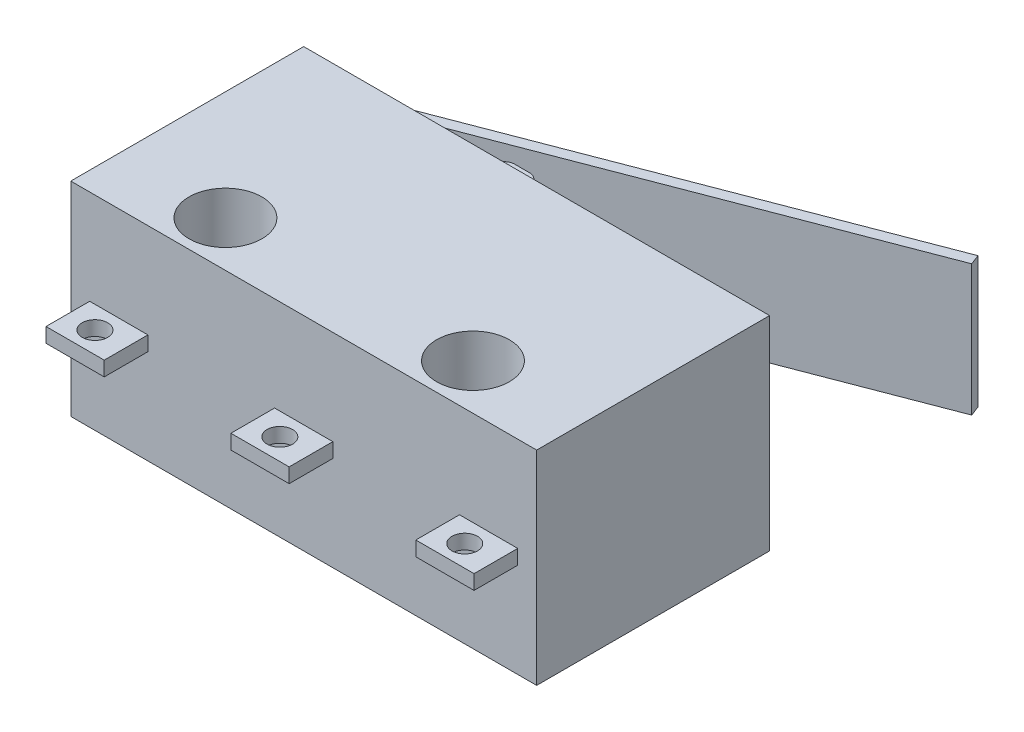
ISO-10303-21;
HEADER;
FILE_DESCRIPTION(('STEP AP214'),'2;1');
FILE_NAME('part.step','',(''),(''),'','','');
FILE_SCHEMA(('AUTOMOTIVE_DESIGN { 1 0 10303 214 1 1 1 1 }'));
ENDSEC;
DATA;
#1=APPLICATION_CONTEXT('core data for automotive mechanical design processes');
#2=APPLICATION_PROTOCOL_DEFINITION('international standard','automotive_design',2000,#1);
#3=PRODUCT_CONTEXT('',#1,'mechanical');
#4=PRODUCT('Part','Part','',(#3));
#5=PRODUCT_RELATED_PRODUCT_CATEGORY('part','',(#4));
#6=PRODUCT_DEFINITION_FORMATION('','',#4);
#7=PRODUCT_DEFINITION_CONTEXT('part definition',#1,'design');
#8=PRODUCT_DEFINITION('design','',#6,#7);
#9=PRODUCT_DEFINITION_SHAPE('','',#8);
#10=(LENGTH_UNIT() NAMED_UNIT(*) SI_UNIT(.MILLI.,.METRE.));
#11=(NAMED_UNIT(*) PLANE_ANGLE_UNIT() SI_UNIT($,.RADIAN.));
#12=(NAMED_UNIT(*) SI_UNIT($,.STERADIAN.) SOLID_ANGLE_UNIT());
#13=UNCERTAINTY_MEASURE_WITH_UNIT(LENGTH_MEASURE(1.E-05),#10,'distance_accuracy_value','');
#14=(GEOMETRIC_REPRESENTATION_CONTEXT(3) GLOBAL_UNCERTAINTY_ASSIGNED_CONTEXT((#13)) GLOBAL_UNIT_ASSIGNED_CONTEXT((#10,
#11,#12)) REPRESENTATION_CONTEXT('',''));
#15=CARTESIAN_POINT('',(0.,0.,0.));
#16=DIRECTION('',(0.,0.,1.));
#17=DIRECTION('',(1.,0.,0.));
#18=AXIS2_PLACEMENT_3D('',#15,#16,#17);
#19=CARTESIAN_POINT('',(0.,5.6,0.));
#20=DIRECTION('',(0.,0.,-1.));
#21=DIRECTION('',(-1.,0.,0.));
#22=AXIS2_PLACEMENT_3D('',#19,#20,#21);
#23=PLANE('',#22);
#24=DIRECTION('',(1.,0.,0.));
#25=VECTOR('',#24,1.);
#26=CARTESIAN_POINT('',(5.6,2.6,0.));
#27=LINE('',#26,#25);
#28=CARTESIAN_POINT('',(5.6,2.6,0.));
#29=VERTEX_POINT('',#28);
#30=CARTESIAN_POINT('',(7.2,2.6,0.));
#31=VERTEX_POINT('',#30);
#32=EDGE_CURVE('E256',#29,#31,#27,.T.);
#33=ORIENTED_EDGE('',*,*,#32,.F.);
#34=DIRECTION('',(0.,-1.,0.));
#35=VECTOR('',#34,1.);
#36=CARTESIAN_POINT('',(5.6,3.,0.));
#37=LINE('',#36,#35);
#38=CARTESIAN_POINT('',(5.6,3.,0.));
#39=VERTEX_POINT('',#38);
#40=EDGE_CURVE('E269',#39,#29,#37,.T.);
#41=ORIENTED_EDGE('',*,*,#40,.F.);
#42=DIRECTION('',(-1.,0.,0.));
#43=VECTOR('',#42,1.);
#44=CARTESIAN_POINT('',(5.6,3.,0.));
#45=LINE('',#44,#43);
#46=CARTESIAN_POINT('',(7.2,3.,0.));
#47=VERTEX_POINT('',#46);
#48=EDGE_CURVE('E278',#47,#39,#45,.T.);
#49=ORIENTED_EDGE('',*,*,#48,.F.);
#50=DIRECTION('',(0.,1.,0.));
#51=VECTOR('',#50,1.);
#52=CARTESIAN_POINT('',(7.2,3.,0.));
#53=LINE('',#52,#51);
#54=EDGE_CURVE('E259',#31,#47,#53,.T.);
#55=ORIENTED_EDGE('',*,*,#54,.F.);
#56=EDGE_LOOP('',(#33,#41,#49,#55));
#57=FACE_BOUND('',#56,.T.);
#58=DIRECTION('',(1.,0.,0.));
#59=VECTOR('',#58,1.);
#60=CARTESIAN_POINT('',(0.,0.,0.));
#61=LINE('',#60,#59);
#62=CARTESIAN_POINT('',(0.,0.,0.));
#63=VERTEX_POINT('',#62);
#64=CARTESIAN_POINT('',(12.8,0.,0.));
#65=VERTEX_POINT('',#64);
#66=EDGE_CURVE('E440',#63,#65,#61,.T.);
#67=ORIENTED_EDGE('',*,*,#66,.T.);
#68=DIRECTION('',(0.,-1.,0.));
#69=VECTOR('',#68,1.);
#70=CARTESIAN_POINT('',(12.8,5.6,0.));
#71=LINE('',#70,#69);
#72=CARTESIAN_POINT('',(12.8,5.6,0.));
#73=VERTEX_POINT('',#72);
#74=EDGE_CURVE('E461',#73,#65,#71,.T.);
#75=ORIENTED_EDGE('',*,*,#74,.F.);
#76=DIRECTION('',(1.,0.,0.));
#77=VECTOR('',#76,1.);
#78=CARTESIAN_POINT('',(0.,5.6,0.));
#79=LINE('',#78,#77);
#80=CARTESIAN_POINT('',(0.,5.6,0.));
#81=VERTEX_POINT('',#80);
#82=EDGE_CURVE('E449',#81,#73,#79,.T.);
#83=ORIENTED_EDGE('',*,*,#82,.F.);
#84=DIRECTION('',(0.,-1.,0.));
#85=VECTOR('',#84,1.);
#86=CARTESIAN_POINT('',(0.,5.6,0.));
#87=LINE('',#86,#85);
#88=EDGE_CURVE('E464',#81,#63,#87,.T.);
#89=ORIENTED_EDGE('',*,*,#88,.T.);
#90=EDGE_LOOP('',(#67,#75,#83,#89));
#91=FACE_BOUND('',#90,.T.);
#92=DIRECTION('',(0.,1.,0.));
#93=VECTOR('',#92,1.);
#94=CARTESIAN_POINT('',(2.12,3.,0.));
#95=LINE('',#94,#93);
#96=CARTESIAN_POINT('',(2.12,2.6,0.));
#97=VERTEX_POINT('',#96);
#98=CARTESIAN_POINT('',(2.12,3.,0.));
#99=VERTEX_POINT('',#98);
#100=EDGE_CURVE('E294',#97,#99,#95,.T.);
#101=ORIENTED_EDGE('',*,*,#100,.F.);
#102=DIRECTION('',(1.,0.,0.));
#103=VECTOR('',#102,1.);
#104=CARTESIAN_POINT('',(0.52,2.6,0.));
#105=LINE('',#104,#103);
#106=CARTESIAN_POINT('',(0.52,2.6,0.));
#107=VERTEX_POINT('',#106);
#108=EDGE_CURVE('E299',#107,#97,#105,.T.);
#109=ORIENTED_EDGE('',*,*,#108,.F.);
#110=DIRECTION('',(0.,-1.,0.));
#111=VECTOR('',#110,1.);
#112=CARTESIAN_POINT('',(0.52,3.,0.));
#113=LINE('',#112,#111);
#114=CARTESIAN_POINT('',(0.52,3.,0.));
#115=VERTEX_POINT('',#114);
#116=EDGE_CURVE('E311',#115,#107,#113,.T.);
#117=ORIENTED_EDGE('',*,*,#116,.F.);
#118=DIRECTION('',(-1.,0.,0.));
#119=VECTOR('',#118,1.);
#120=CARTESIAN_POINT('',(0.52,3.,0.));
#121=LINE('',#120,#119);
#122=EDGE_CURVE('E308',#99,#115,#121,.T.);
#123=ORIENTED_EDGE('',*,*,#122,.F.);
#124=EDGE_LOOP('',(#101,#109,#117,#123));
#125=FACE_BOUND('',#124,.T.);
#126=DIRECTION('',(1.,0.,0.));
#127=VECTOR('',#126,1.);
#128=CARTESIAN_POINT('',(10.68,2.6,0.));
#129=LINE('',#128,#127);
#130=CARTESIAN_POINT('',(10.68,2.6,0.));
#131=VERTEX_POINT('',#130);
#132=CARTESIAN_POINT('',(12.28,2.6,0.));
#133=VERTEX_POINT('',#132);
#134=EDGE_CURVE('E255',#131,#133,#129,.T.);
#135=ORIENTED_EDGE('',*,*,#134,.F.);
#136=DIRECTION('',(0.,-1.,0.));
#137=VECTOR('',#136,1.);
#138=CARTESIAN_POINT('',(10.68,3.,0.));
#139=LINE('',#138,#137);
#140=CARTESIAN_POINT('',(10.68,3.,0.));
#141=VERTEX_POINT('',#140);
#142=EDGE_CURVE('E252',#141,#131,#139,.T.);
#143=ORIENTED_EDGE('',*,*,#142,.F.);
#144=DIRECTION('',(-1.,0.,0.));
#145=VECTOR('',#144,1.);
#146=CARTESIAN_POINT('',(10.68,3.,0.));
#147=LINE('',#146,#145);
#148=CARTESIAN_POINT('',(12.28,3.,0.));
#149=VERTEX_POINT('',#148);
#150=EDGE_CURVE('E59',#149,#141,#147,.T.);
#151=ORIENTED_EDGE('',*,*,#150,.F.);
#152=DIRECTION('',(0.,1.,0.));
#153=VECTOR('',#152,1.);
#154=CARTESIAN_POINT('',(12.28,3.,0.));
#155=LINE('',#154,#153);
#156=EDGE_CURVE('E54',#133,#149,#155,.T.);
#157=ORIENTED_EDGE('',*,*,#156,.F.);
#158=EDGE_LOOP('',(#135,#143,#151,#157));
#159=FACE_BOUND('',#158,.T.);
#160=ADVANCED_FACE('F37',(#57,#91,#125,#159),#23,.F.);
#161=CARTESIAN_POINT('',(0.,5.6,-6.4));
#162=DIRECTION('',(0.,0.,1.));
#163=DIRECTION('',(1.,0.,0.));
#164=AXIS2_PLACEMENT_3D('',#161,#162,#163);
#165=PLANE('',#164);
#166=DIRECTION('',(0.,1.,0.));
#167=VECTOR('',#166,1.);
#168=CARTESIAN_POINT('',(4.,1.4,-6.4));
#169=LINE('',#168,#167);
#170=CARTESIAN_POINT('',(4.,1.4,-6.4));
#171=VERTEX_POINT('',#170);
#172=CARTESIAN_POINT('',(4.,4.2,-6.4));
#173=VERTEX_POINT('',#172);
#174=EDGE_CURVE('E399',#171,#173,#169,.T.);
#175=ORIENTED_EDGE('',*,*,#174,.F.);
#176=DIRECTION('',(-1.,0.,0.));
#177=VECTOR('',#176,1.);
#178=CARTESIAN_POINT('',(4.,1.4,-6.4));
#179=LINE('',#178,#177);
#180=CARTESIAN_POINT('',(5.,1.4,-6.4));
#181=VERTEX_POINT('',#180);
#182=EDGE_CURVE('E408',#181,#171,#179,.T.);
#183=ORIENTED_EDGE('',*,*,#182,.F.);
#184=DIRECTION('',(0.,-1.,0.));
#185=VECTOR('',#184,1.);
#186=CARTESIAN_POINT('',(5.,1.4,-6.4));
#187=LINE('',#186,#185);
#188=CARTESIAN_POINT('',(5.,4.2,-6.4));
#189=VERTEX_POINT('',#188);
#190=EDGE_CURVE('E405',#189,#181,#187,.T.);
#191=ORIENTED_EDGE('',*,*,#190,.F.);
#192=DIRECTION('',(1.,0.,0.));
#193=VECTOR('',#192,1.);
#194=CARTESIAN_POINT('',(4.,4.2,-6.4));
#195=LINE('',#194,#193);
#196=EDGE_CURVE('E402',#173,#189,#195,.T.);
#197=ORIENTED_EDGE('',*,*,#196,.F.);
#198=EDGE_LOOP('',(#175,#183,#191,#197));
#199=FACE_BOUND('',#198,.T.);
#200=DIRECTION('',(-1.,0.,0.));
#201=VECTOR('',#200,1.);
#202=CARTESIAN_POINT('',(0.,0.,-6.4));
#203=LINE('',#202,#201);
#204=CARTESIAN_POINT('',(12.8,0.,-6.4));
#205=VERTEX_POINT('',#204);
#206=CARTESIAN_POINT('',(0.,0.,-6.4));
#207=VERTEX_POINT('',#206);
#208=EDGE_CURVE('E444',#205,#207,#203,.T.);
#209=ORIENTED_EDGE('',*,*,#208,.T.);
#210=DIRECTION('',(0.,-1.,0.));
#211=VECTOR('',#210,1.);
#212=CARTESIAN_POINT('',(0.,5.6,-6.4));
#213=LINE('',#212,#211);
#214=CARTESIAN_POINT('',(0.,5.6,-6.4));
#215=VERTEX_POINT('',#214);
#216=EDGE_CURVE('E455',#215,#207,#213,.T.);
#217=ORIENTED_EDGE('',*,*,#216,.F.);
#218=DIRECTION('',(-1.,0.,0.));
#219=VECTOR('',#218,1.);
#220=CARTESIAN_POINT('',(0.,5.6,-6.4));
#221=LINE('',#220,#219);
#222=CARTESIAN_POINT('',(12.8,5.6,-6.4));
#223=VERTEX_POINT('',#222);
#224=EDGE_CURVE('E453',#223,#215,#221,.T.);
#225=ORIENTED_EDGE('',*,*,#224,.F.);
#226=DIRECTION('',(0.,-1.,0.));
#227=VECTOR('',#226,1.);
#228=CARTESIAN_POINT('',(12.8,5.6,-6.4));
#229=LINE('',#228,#227);
#230=EDGE_CURVE('E458',#223,#205,#229,.T.);
#231=ORIENTED_EDGE('',*,*,#230,.T.);
#232=EDGE_LOOP('',(#209,#217,#225,#231));
#233=FACE_BOUND('',#232,.T.);
#234=DIRECTION('',(0.,-1.,0.));
#235=VECTOR('',#234,1.);
#236=CARTESIAN_POINT('',(1.3,4.6,-6.4));
#237=LINE('',#236,#235);
#238=CARTESIAN_POINT('',(1.3,4.6,-6.4));
#239=VERTEX_POINT('',#238);
#240=CARTESIAN_POINT('',(1.3,1.,-6.4));
#241=VERTEX_POINT('',#240);
#242=EDGE_CURVE('E327',#239,#241,#237,.T.);
#243=ORIENTED_EDGE('',*,*,#242,.F.);
#244=DIRECTION('',(1.,0.,0.));
#245=VECTOR('',#244,1.);
#246=CARTESIAN_POINT('',(1.3,4.6,-6.4));
#247=LINE('',#246,#245);
#248=CARTESIAN_POINT('',(0.999999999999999,4.6,-6.4));
#249=VERTEX_POINT('',#248);
#250=EDGE_CURVE('E332',#249,#239,#247,.T.);
#251=ORIENTED_EDGE('',*,*,#250,.F.);
#252=DIRECTION('',(0.,1.,0.));
#253=VECTOR('',#252,1.);
#254=CARTESIAN_POINT('',(0.999999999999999,4.6,-6.4));
#255=LINE('',#254,#253);
#256=CARTESIAN_POINT('',(0.999999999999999,1.,-6.4));
#257=VERTEX_POINT('',#256);
#258=EDGE_CURVE('E341',#257,#249,#255,.T.);
#259=ORIENTED_EDGE('',*,*,#258,.F.);
#260=DIRECTION('',(-1.,0.,0.));
#261=VECTOR('',#260,1.);
#262=CARTESIAN_POINT('',(1.3,1.,-6.4));
#263=LINE('',#262,#261);
#264=EDGE_CURVE('E338',#241,#257,#263,.T.);
#265=ORIENTED_EDGE('',*,*,#264,.F.);
#266=EDGE_LOOP('',(#243,#251,#259,#265));
#267=FACE_BOUND('',#266,.T.);
#268=ADVANCED_FACE('F524',(#199,#233,#267),#165,.F.);
#269=CARTESIAN_POINT('',(0.,5.6,-6.4));
#270=DIRECTION('',(0.,-1.,0.));
#271=DIRECTION('',(0.,0.,-1.));
#272=AXIS2_PLACEMENT_3D('',#269,#270,#271);
#273=PLANE('',#272);
#274=CARTESIAN_POINT('',(3.,5.6,-1.25));
#275=DIRECTION('',(0.,1.,0.));
#276=DIRECTION('',(0.,0.,1.));
#277=AXIS2_PLACEMENT_3D('',#274,#275,#276);
#278=CIRCLE('',#277,1.);
#279=CARTESIAN_POINT('',(3.,5.6,-0.25));
#280=VERTEX_POINT('',#279);
#281=EDGE_CURVE('E434',#280,#280,#278,.T.);
#282=ORIENTED_EDGE('',*,*,#281,.F.);
#283=EDGE_LOOP('',(#282));
#284=FACE_BOUND('',#283,.T.);
#285=DIRECTION('',(0.,0.,1.));
#286=VECTOR('',#285,1.);
#287=CARTESIAN_POINT('',(0.,5.6,0.));
#288=LINE('',#287,#286);
#289=EDGE_CURVE('E446',#215,#81,#288,.T.);
#290=ORIENTED_EDGE('',*,*,#289,.T.);
#291=ORIENTED_EDGE('',*,*,#82,.T.);
#292=DIRECTION('',(0.,0.,-1.));
#293=VECTOR('',#292,1.);
#294=CARTESIAN_POINT('',(12.8,5.6,0.));
#295=LINE('',#294,#293);
#296=EDGE_CURVE('E451',#73,#223,#295,.T.);
#297=ORIENTED_EDGE('',*,*,#296,.T.);
#298=ORIENTED_EDGE('',*,*,#224,.T.);
#299=EDGE_LOOP('',(#290,#291,#297,#298));
#300=FACE_BOUND('',#299,.T.);
#301=CARTESIAN_POINT('',(9.8,5.6,-1.25));
#302=DIRECTION('',(0.,1.,0.));
#303=DIRECTION('',(0.,0.,-1.));
#304=AXIS2_PLACEMENT_3D('',#301,#302,#303);
#305=CIRCLE('',#304,1.);
#306=CARTESIAN_POINT('',(9.8,5.6,-2.25));
#307=VERTEX_POINT('',#306);
#308=EDGE_CURVE('E428',#307,#307,#305,.T.);
#309=ORIENTED_EDGE('',*,*,#308,.F.);
#310=EDGE_LOOP('',(#309));
#311=FACE_BOUND('',#310,.T.);
#312=ADVANCED_FACE('F529',(#284,#300,#311),#273,.F.);
#313=CARTESIAN_POINT('',(0.,0.,-6.4));
#314=DIRECTION('',(0.,-1.,0.));
#315=DIRECTION('',(0.,0.,-1.));
#316=AXIS2_PLACEMENT_3D('',#313,#314,#315);
#317=PLANE('',#316);
#318=CARTESIAN_POINT('',(3.,0.,-1.25));
#319=DIRECTION('',(0.,1.,0.));
#320=DIRECTION('',(0.,0.,1.));
#321=AXIS2_PLACEMENT_3D('',#318,#319,#320);
#322=CIRCLE('',#321,1.);
#323=CARTESIAN_POINT('',(3.,0.,-0.25));
#324=VERTEX_POINT('',#323);
#325=EDGE_CURVE('E431',#324,#324,#322,.T.);
#326=ORIENTED_EDGE('',*,*,#325,.T.);
#327=EDGE_LOOP('',(#326));
#328=FACE_BOUND('',#327,.T.);
#329=DIRECTION('',(0.,0.,1.));
#330=VECTOR('',#329,1.);
#331=CARTESIAN_POINT('',(0.,0.,0.));
#332=LINE('',#331,#330);
#333=EDGE_CURVE('E437',#207,#63,#332,.T.);
#334=ORIENTED_EDGE('',*,*,#333,.F.);
#335=ORIENTED_EDGE('',*,*,#208,.F.);
#336=DIRECTION('',(0.,0.,-1.));
#337=VECTOR('',#336,1.);
#338=CARTESIAN_POINT('',(12.8,0.,0.));
#339=LINE('',#338,#337);
#340=EDGE_CURVE('E442',#65,#205,#339,.T.);
#341=ORIENTED_EDGE('',*,*,#340,.F.);
#342=ORIENTED_EDGE('',*,*,#66,.F.);
#343=EDGE_LOOP('',(#334,#335,#341,#342));
#344=FACE_BOUND('',#343,.T.);
#345=CARTESIAN_POINT('',(9.8,0.,-1.25));
#346=DIRECTION('',(0.,1.,0.));
#347=DIRECTION('',(0.,0.,-1.));
#348=AXIS2_PLACEMENT_3D('',#345,#346,#347);
#349=CIRCLE('',#348,1.);
#350=CARTESIAN_POINT('',(9.8,0.,-2.25));
#351=VERTEX_POINT('',#350);
#352=EDGE_CURVE('E425',#351,#351,#349,.T.);
#353=ORIENTED_EDGE('',*,*,#352,.T.);
#354=EDGE_LOOP('',(#353));
#355=FACE_BOUND('',#354,.T.);
#356=ADVANCED_FACE('F541',(#328,#344,#355),#317,.T.);
#357=CARTESIAN_POINT('',(0.,5.6,0.));
#358=DIRECTION('',(1.,0.,0.));
#359=DIRECTION('',(0.,0.,-1.));
#360=AXIS2_PLACEMENT_3D('',#357,#358,#359);
#361=PLANE('',#360);
#362=ORIENTED_EDGE('',*,*,#333,.T.);
#363=ORIENTED_EDGE('',*,*,#88,.F.);
#364=ORIENTED_EDGE('',*,*,#289,.F.);
#365=ORIENTED_EDGE('',*,*,#216,.T.);
#366=EDGE_LOOP('',(#362,#363,#364,#365));
#367=FACE_BOUND('',#366,.T.);
#368=ADVANCED_FACE('F39',(#367),#361,.F.);
#369=CARTESIAN_POINT('',(12.8,5.6,0.));
#370=DIRECTION('',(-1.,0.,0.));
#371=DIRECTION('',(0.,0.,1.));
#372=AXIS2_PLACEMENT_3D('',#369,#370,#371);
#373=PLANE('',#372);
#374=ORIENTED_EDGE('',*,*,#340,.T.);
#375=ORIENTED_EDGE('',*,*,#230,.F.);
#376=ORIENTED_EDGE('',*,*,#296,.F.);
#377=ORIENTED_EDGE('',*,*,#74,.T.);
#378=EDGE_LOOP('',(#374,#375,#376,#377));
#379=FACE_BOUND('',#378,.T.);
#380=ADVANCED_FACE('F534',(#379),#373,.F.);
#381=CARTESIAN_POINT('',(3.,5.6,-1.25));
#382=DIRECTION('',(0.,-1.,0.));
#383=DIRECTION('',(0.,0.,-1.));
#384=AXIS2_PLACEMENT_3D('',#381,#382,#383);
#385=CYLINDRICAL_SURFACE('',#384,1.);
#386=ORIENTED_EDGE('',*,*,#281,.T.);
#387=EDGE_LOOP('',(#386));
#388=FACE_BOUND('',#387,.T.);
#389=ORIENTED_EDGE('',*,*,#325,.F.);
#390=EDGE_LOOP('',(#389));
#391=FACE_BOUND('',#390,.T.);
#392=ADVANCED_FACE('F536',(#388,#391),#385,.F.);
#393=CARTESIAN_POINT('',(9.8,5.6,-1.25));
#394=DIRECTION('',(0.,-1.,0.));
#395=DIRECTION('',(0.,0.,-1.));
#396=AXIS2_PLACEMENT_3D('',#393,#394,#395);
#397=CYLINDRICAL_SURFACE('',#396,1.);
#398=ORIENTED_EDGE('',*,*,#308,.T.);
#399=EDGE_LOOP('',(#398));
#400=FACE_BOUND('',#399,.T.);
#401=ORIENTED_EDGE('',*,*,#352,.F.);
#402=EDGE_LOOP('',(#401));
#403=FACE_BOUND('',#402,.T.);
#404=ADVANCED_FACE('F548',(#400,#403),#397,.F.);
#405=CARTESIAN_POINT('',(4.,1.4,-7.9));
#406=DIRECTION('',(1.,0.,0.));
#407=DIRECTION('',(0.,0.,-1.));
#408=AXIS2_PLACEMENT_3D('',#405,#406,#407);
#409=PLANE('',#408);
#410=DIRECTION('',(0.,0.,1.));
#411=VECTOR('',#410,1.);
#412=CARTESIAN_POINT('',(4.,4.2,-7.9));
#413=LINE('',#412,#411);
#414=CARTESIAN_POINT('',(4.,4.2,-7.6));
#415=VERTEX_POINT('',#414);
#416=EDGE_CURVE('E423',#415,#173,#413,.T.);
#417=ORIENTED_EDGE('',*,*,#416,.F.);
#418=DIRECTION('',(0.,1.,0.));
#419=VECTOR('',#418,1.);
#420=CARTESIAN_POINT('',(4.,1.4,-7.6));
#421=LINE('',#420,#419);
#422=CARTESIAN_POINT('',(4.,1.4,-7.6));
#423=VERTEX_POINT('',#422);
#424=EDGE_CURVE('E11',#415,#423,#421,.F.);
#425=ORIENTED_EDGE('',*,*,#424,.T.);
#426=DIRECTION('',(0.,0.,1.));
#427=VECTOR('',#426,1.);
#428=CARTESIAN_POINT('',(4.,1.4,-7.9));
#429=LINE('',#428,#427);
#430=EDGE_CURVE('E417',#423,#171,#429,.T.);
#431=ORIENTED_EDGE('',*,*,#430,.T.);
#432=ORIENTED_EDGE('',*,*,#174,.T.);
#433=EDGE_LOOP('',(#417,#425,#431,#432));
#434=FACE_BOUND('',#433,.T.);
#435=ADVANCED_FACE('F552',(#434),#409,.F.);
#436=CARTESIAN_POINT('',(4.,4.2,-7.9));
#437=DIRECTION('',(0.,-1.,0.));
#438=DIRECTION('',(0.,0.,-1.));
#439=AXIS2_PLACEMENT_3D('',#436,#437,#438);
#440=PLANE('',#439);
#441=DIRECTION('',(0.,0.,1.));
#442=VECTOR('',#441,1.);
#443=CARTESIAN_POINT('',(5.,4.2,-7.9));
#444=LINE('',#443,#442);
#445=CARTESIAN_POINT('',(5.,4.2,-7.6));
#446=VERTEX_POINT('',#445);
#447=EDGE_CURVE('E421',#446,#189,#444,.T.);
#448=ORIENTED_EDGE('',*,*,#447,.F.);
#449=CARTESIAN_POINT('',(4.7,4.2,-7.6));
#450=DIRECTION('',(0.,-1.,0.));
#451=DIRECTION('',(0.,0.,-1.));
#452=AXIS2_PLACEMENT_3D('',#449,#450,#451);
#453=CIRCLE('',#452,0.3);
#454=CARTESIAN_POINT('',(4.7,4.2,-7.9));
#455=VERTEX_POINT('',#454);
#456=EDGE_CURVE('E46',#446,#455,#453,.F.);
#457=ORIENTED_EDGE('',*,*,#456,.T.);
#458=DIRECTION('',(1.,0.,0.));
#459=VECTOR('',#458,1.);
#460=CARTESIAN_POINT('',(4.,4.2,-7.9));
#461=LINE('',#460,#459);
#462=CARTESIAN_POINT('',(4.3,4.2,-7.9));
#463=VERTEX_POINT('',#462);
#464=EDGE_CURVE('E411',#463,#455,#461,.T.);
#465=ORIENTED_EDGE('',*,*,#464,.F.);
#466=CARTESIAN_POINT('',(4.3,4.2,-7.6));
#467=DIRECTION('',(0.,-1.,0.));
#468=DIRECTION('',(0.,0.,-1.));
#469=AXIS2_PLACEMENT_3D('',#466,#467,#468);
#470=CIRCLE('',#469,0.3);
#471=EDGE_CURVE('E479',#463,#415,#470,.F.);
#472=ORIENTED_EDGE('',*,*,#471,.T.);
#473=ORIENTED_EDGE('',*,*,#416,.T.);
#474=ORIENTED_EDGE('',*,*,#196,.T.);
#475=EDGE_LOOP('',(#448,#457,#465,#472,#473,#474));
#476=FACE_BOUND('',#475,.T.);
#477=ADVANCED_FACE('F556',(#476),#440,.F.);
#478=CARTESIAN_POINT('',(5.,1.4,-7.9));
#479=DIRECTION('',(-1.,0.,0.));
#480=DIRECTION('',(0.,0.,1.));
#481=AXIS2_PLACEMENT_3D('',#478,#479,#480);
#482=PLANE('',#481);
#483=DIRECTION('',(0.,0.,1.));
#484=VECTOR('',#483,1.);
#485=CARTESIAN_POINT('',(5.,1.4,-7.9));
#486=LINE('',#485,#484);
#487=CARTESIAN_POINT('',(5.,1.4,-7.6));
#488=VERTEX_POINT('',#487);
#489=EDGE_CURVE('E419',#488,#181,#486,.T.);
#490=ORIENTED_EDGE('',*,*,#489,.F.);
#491=DIRECTION('',(0.,-1.,0.));
#492=VECTOR('',#491,1.);
#493=CARTESIAN_POINT('',(5.,4.2,-7.6));
#494=LINE('',#493,#492);
#495=EDGE_CURVE('E477',#488,#446,#494,.F.);
#496=ORIENTED_EDGE('',*,*,#495,.T.);
#497=ORIENTED_EDGE('',*,*,#447,.T.);
#498=ORIENTED_EDGE('',*,*,#190,.T.);
#499=EDGE_LOOP('',(#490,#496,#497,#498));
#500=FACE_BOUND('',#499,.T.);
#501=ADVANCED_FACE('F560',(#500),#482,.F.);
#502=CARTESIAN_POINT('',(4.,1.4,-7.9));
#503=DIRECTION('',(0.,1.,0.));
#504=DIRECTION('',(0.,0.,1.));
#505=AXIS2_PLACEMENT_3D('',#502,#503,#504);
#506=PLANE('',#505);
#507=DIRECTION('',(-1.,0.,0.));
#508=VECTOR('',#507,1.);
#509=CARTESIAN_POINT('',(4.,1.4,-7.9));
#510=LINE('',#509,#508);
#511=CARTESIAN_POINT('',(4.7,1.4,-7.9));
#512=VERTEX_POINT('',#511);
#513=CARTESIAN_POINT('',(4.3,1.4,-7.9));
#514=VERTEX_POINT('',#513);
#515=EDGE_CURVE('E414',#512,#514,#510,.T.);
#516=ORIENTED_EDGE('',*,*,#515,.F.);
#517=CARTESIAN_POINT('',(4.7,1.4,-7.6));
#518=DIRECTION('',(0.,1.,0.));
#519=DIRECTION('',(0.,0.,1.));
#520=AXIS2_PLACEMENT_3D('',#517,#518,#519);
#521=CIRCLE('',#520,0.3);
#522=EDGE_CURVE('E475',#512,#488,#521,.F.);
#523=ORIENTED_EDGE('',*,*,#522,.T.);
#524=ORIENTED_EDGE('',*,*,#489,.T.);
#525=ORIENTED_EDGE('',*,*,#182,.T.);
#526=ORIENTED_EDGE('',*,*,#430,.F.);
#527=CARTESIAN_POINT('',(4.3,1.4,-7.6));
#528=DIRECTION('',(0.,1.,0.));
#529=DIRECTION('',(0.,0.,1.));
#530=AXIS2_PLACEMENT_3D('',#527,#528,#529);
#531=CIRCLE('',#530,0.3);
#532=EDGE_CURVE('E473',#423,#514,#531,.F.);
#533=ORIENTED_EDGE('',*,*,#532,.T.);
#534=EDGE_LOOP('',(#516,#523,#524,#525,#526,#533));
#535=FACE_BOUND('',#534,.T.);
#536=ADVANCED_FACE('F564',(#535),#506,.F.);
#537=CARTESIAN_POINT('',(4.,4.2,-7.9));
#538=DIRECTION('',(0.,0.,-1.));
#539=DIRECTION('',(-1.,0.,0.));
#540=AXIS2_PLACEMENT_3D('',#537,#538,#539);
#541=PLANE('',#540);
#542=ORIENTED_EDGE('',*,*,#464,.T.);
#543=DIRECTION('',(0.,-1.,0.));
#544=VECTOR('',#543,1.);
#545=CARTESIAN_POINT('',(4.7,1.4,-7.9));
#546=LINE('',#545,#544);
#547=EDGE_CURVE('E470',#455,#512,#546,.T.);
#548=ORIENTED_EDGE('',*,*,#547,.T.);
#549=ORIENTED_EDGE('',*,*,#515,.T.);
#550=DIRECTION('',(0.,1.,0.));
#551=VECTOR('',#550,1.);
#552=CARTESIAN_POINT('',(4.3,4.2,-7.9));
#553=LINE('',#552,#551);
#554=EDGE_CURVE('E467',#514,#463,#553,.T.);
#555=ORIENTED_EDGE('',*,*,#554,.T.);
#556=EDGE_LOOP('',(#542,#548,#549,#555));
#557=FACE_BOUND('',#556,.T.);
#558=ADVANCED_FACE('F568',(#557),#541,.T.);
#559=CARTESIAN_POINT('',(4.7,4.2,-7.6));
#560=DIRECTION('',(0.,1.,0.));
#561=DIRECTION('',(0.,0.,1.));
#562=AXIS2_PLACEMENT_3D('',#559,#560,#561);
#563=CYLINDRICAL_SURFACE('',#562,0.3);
#564=ORIENTED_EDGE('',*,*,#456,.F.);
#565=ORIENTED_EDGE('',*,*,#495,.F.);
#566=ORIENTED_EDGE('',*,*,#522,.F.);
#567=ORIENTED_EDGE('',*,*,#547,.F.);
#568=EDGE_LOOP('',(#564,#565,#566,#567));
#569=FACE_BOUND('',#568,.T.);
#570=ADVANCED_FACE('F572',(#569),#563,.T.);
#571=CARTESIAN_POINT('',(4.3,4.2,-7.6));
#572=DIRECTION('',(0.,-1.,0.));
#573=DIRECTION('',(0.,0.,-1.));
#574=AXIS2_PLACEMENT_3D('',#571,#572,#573);
#575=CYLINDRICAL_SURFACE('',#574,0.3);
#576=ORIENTED_EDGE('',*,*,#532,.F.);
#577=ORIENTED_EDGE('',*,*,#424,.F.);
#578=ORIENTED_EDGE('',*,*,#471,.F.);
#579=ORIENTED_EDGE('',*,*,#554,.F.);
#580=EDGE_LOOP('',(#576,#577,#578,#579));
#581=FACE_BOUND('',#580,.T.);
#582=ADVANCED_FACE('F576',(#581),#575,.T.);
#583=CARTESIAN_POINT('',(1.2569879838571,4.6,-7.1015752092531));
#584=DIRECTION('',(-0.357530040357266,0.,-0.933901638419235));
#585=DIRECTION('',(-0.933901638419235,0.,0.357530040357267));
#586=AXIS2_PLACEMENT_3D('',#583,#584,#585);
#587=PLANE('',#586);
#588=DIRECTION('',(0.,1.,0.));
#589=VECTOR('',#588,1.);
#590=CARTESIAN_POINT('',(1.2569879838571,4.6,-7.1015752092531));
#591=LINE('',#590,#589);
#592=CARTESIAN_POINT('',(1.2569879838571,1.,-7.1015752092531));
#593=VERTEX_POINT('',#592);
#594=CARTESIAN_POINT('',(1.2569879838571,4.6,-7.1015752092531));
#595=VERTEX_POINT('',#594);
#596=EDGE_CURVE('E360',#593,#595,#591,.T.);
#597=ORIENTED_EDGE('',*,*,#596,.T.);
#598=DIRECTION('',(0.933901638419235,0.,-0.357530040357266));
#599=VECTOR('',#598,1.);
#600=CARTESIAN_POINT('',(1.2569879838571,4.6,-7.1015752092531));
#601=LINE('',#600,#599);
#602=CARTESIAN_POINT('',(13.2370917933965,4.6,-11.6879757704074));
#603=VERTEX_POINT('',#602);
#604=EDGE_CURVE('E390',#595,#603,#601,.T.);
#605=ORIENTED_EDGE('',*,*,#604,.T.);
#606=DIRECTION('',(0.,1.,0.));
#607=VECTOR('',#606,1.);
#608=CARTESIAN_POINT('',(13.2370917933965,4.6,-11.6879757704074));
#609=LINE('',#608,#607);
#610=CARTESIAN_POINT('',(13.2370917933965,1.,-11.6879757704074));
#611=VERTEX_POINT('',#610);
#612=EDGE_CURVE('E381',#611,#603,#609,.T.);
#613=ORIENTED_EDGE('',*,*,#612,.F.);
#614=DIRECTION('',(0.933901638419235,0.,-0.357530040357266));
#615=VECTOR('',#614,1.);
#616=CARTESIAN_POINT('',(1.2569879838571,1.,-7.1015752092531));
#617=LINE('',#616,#615);
#618=EDGE_CURVE('E393',#593,#611,#617,.T.);
#619=ORIENTED_EDGE('',*,*,#618,.F.);
#620=EDGE_LOOP('',(#597,#605,#613,#619));
#621=FACE_BOUND('',#620,.T.);
#622=ADVANCED_FACE('F580',(#621),#587,.T.);
#623=CARTESIAN_POINT('',(1.36424699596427,4.6,-6.82140471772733));
#624=DIRECTION('',(0.357530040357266,0.,0.933901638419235));
#625=DIRECTION('',(0.933901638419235,0.,-0.357530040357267));
#626=AXIS2_PLACEMENT_3D('',#623,#624,#625);
#627=PLANE('',#626);
#628=DIRECTION('',(0.,-1.,0.));
#629=VECTOR('',#628,1.);
#630=CARTESIAN_POINT('',(1.36424699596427,4.6,-6.82140471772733));
#631=LINE('',#630,#629);
#632=CARTESIAN_POINT('',(1.36424699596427,4.6,-6.82140471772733));
#633=VERTEX_POINT('',#632);
#634=CARTESIAN_POINT('',(1.36424699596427,1.,-6.82140471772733));
#635=VERTEX_POINT('',#634);
#636=EDGE_CURVE('E357',#633,#635,#631,.T.);
#637=ORIENTED_EDGE('',*,*,#636,.T.);
#638=DIRECTION('',(0.933901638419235,0.,-0.357530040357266));
#639=VECTOR('',#638,1.);
#640=CARTESIAN_POINT('',(1.36424699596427,1.,-6.82140471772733));
#641=LINE('',#640,#639);
#642=CARTESIAN_POINT('',(13.3443508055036,1.,-11.4078052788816));
#643=VERTEX_POINT('',#642);
#644=EDGE_CURVE('E396',#635,#643,#641,.T.);
#645=ORIENTED_EDGE('',*,*,#644,.T.);
#646=DIRECTION('',(0.,-1.,0.));
#647=VECTOR('',#646,1.);
#648=CARTESIAN_POINT('',(13.3443508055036,4.6,-11.4078052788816));
#649=LINE('',#648,#647);
#650=CARTESIAN_POINT('',(13.3443508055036,4.6,-11.4078052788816));
#651=VERTEX_POINT('',#650);
#652=EDGE_CURVE('E375',#651,#643,#649,.T.);
#653=ORIENTED_EDGE('',*,*,#652,.F.);
#654=DIRECTION('',(0.933901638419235,0.,-0.357530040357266));
#655=VECTOR('',#654,1.);
#656=CARTESIAN_POINT('',(1.36424699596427,4.6,-6.82140471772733));
#657=LINE('',#656,#655);
#658=EDGE_CURVE('E387',#633,#651,#657,.T.);
#659=ORIENTED_EDGE('',*,*,#658,.F.);
#660=EDGE_LOOP('',(#637,#645,#653,#659));
#661=FACE_BOUND('',#660,.T.);
#662=ADVANCED_FACE('F584',(#661),#627,.T.);
#663=CARTESIAN_POINT('',(1.4,2.8,-6.72801455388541));
#664=DIRECTION('',(0.,-1.,0.));
#665=DIRECTION('',(0.,0.,-1.));
#666=AXIS2_PLACEMENT_3D('',#663,#664,#665);
#667=CYLINDRICAL_SURFACE('',#666,0.400000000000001);
#668=DIRECTION('',(0.,1.,0.));
#669=VECTOR('',#668,1.);
#670=CARTESIAN_POINT('',(1.,4.6,-6.7280145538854));
#671=LINE('',#670,#669);
#672=CARTESIAN_POINT('',(1.,1.,-6.7280145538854));
#673=VERTEX_POINT('',#672);
#674=CARTESIAN_POINT('',(1.,4.6,-6.7280145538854));
#675=VERTEX_POINT('',#674);
#676=EDGE_CURVE('E331',#673,#675,#671,.T.);
#677=ORIENTED_EDGE('',*,*,#676,.T.);
#678=CARTESIAN_POINT('',(1.4,4.6,-6.72801455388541));
#679=DIRECTION('',(0.,-1.,0.));
#680=DIRECTION('',(0.,0.,-1.));
#681=AXIS2_PLACEMENT_3D('',#678,#679,#680);
#682=CIRCLE('',#681,0.400000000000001);
#683=EDGE_CURVE('E366',#675,#595,#682,.T.);
#684=ORIENTED_EDGE('',*,*,#683,.T.);
#685=ORIENTED_EDGE('',*,*,#596,.F.);
#686=CARTESIAN_POINT('',(1.4,1.,-6.72801455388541));
#687=DIRECTION('',(0.,-1.,0.));
#688=DIRECTION('',(0.,0.,-1.));
#689=AXIS2_PLACEMENT_3D('',#686,#687,#688);
#690=CIRCLE('',#689,0.400000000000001);
#691=EDGE_CURVE('E369',#673,#593,#690,.T.);
#692=ORIENTED_EDGE('',*,*,#691,.F.);
#693=EDGE_LOOP('',(#677,#684,#685,#692));
#694=FACE_BOUND('',#693,.T.);
#695=ADVANCED_FACE('F588',(#694),#667,.T.);
#696=CARTESIAN_POINT('',(1.4,2.8,-6.72801455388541));
#697=DIRECTION('',(0.,-1.,0.));
#698=DIRECTION('',(0.,0.,-1.));
#699=AXIS2_PLACEMENT_3D('',#696,#697,#698);
#700=CYLINDRICAL_SURFACE('',#699,0.1);
#701=DIRECTION('',(0.,-1.,0.));
#702=VECTOR('',#701,1.);
#703=CARTESIAN_POINT('',(1.3,4.6,-6.7280145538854));
#704=LINE('',#703,#702);
#705=CARTESIAN_POINT('',(1.3,4.6,-6.7280145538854));
#706=VERTEX_POINT('',#705);
#707=CARTESIAN_POINT('',(1.3,1.,-6.7280145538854));
#708=VERTEX_POINT('',#707);
#709=EDGE_CURVE('E328',#706,#708,#704,.T.);
#710=ORIENTED_EDGE('',*,*,#709,.T.);
#711=CARTESIAN_POINT('',(1.4,1.,-6.72801455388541));
#712=DIRECTION('',(0.,-1.,0.));
#713=DIRECTION('',(0.,0.,-1.));
#714=AXIS2_PLACEMENT_3D('',#711,#712,#713);
#715=CIRCLE('',#714,0.1);
#716=EDGE_CURVE('E372',#708,#635,#715,.T.);
#717=ORIENTED_EDGE('',*,*,#716,.T.);
#718=ORIENTED_EDGE('',*,*,#636,.F.);
#719=CARTESIAN_POINT('',(1.4,4.6,-6.72801455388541));
#720=DIRECTION('',(0.,-1.,0.));
#721=DIRECTION('',(0.,0.,-1.));
#722=AXIS2_PLACEMENT_3D('',#719,#720,#721);
#723=CIRCLE('',#722,0.1);
#724=EDGE_CURVE('E363',#706,#633,#723,.T.);
#725=ORIENTED_EDGE('',*,*,#724,.F.);
#726=EDGE_LOOP('',(#710,#717,#718,#725));
#727=FACE_BOUND('',#726,.T.);
#728=ADVANCED_FACE('F592',(#727),#700,.F.);
#729=CARTESIAN_POINT('',(1.3,4.6,-6.7280145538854));
#730=DIRECTION('',(-1.,0.,0.));
#731=DIRECTION('',(0.,0.,1.));
#732=AXIS2_PLACEMENT_3D('',#729,#730,#731);
#733=PLANE('',#732);
#734=ORIENTED_EDGE('',*,*,#242,.T.);
#735=DIRECTION('',(0.,0.,1.));
#736=VECTOR('',#735,1.);
#737=CARTESIAN_POINT('',(1.3,1.,-6.7280145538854));
#738=LINE('',#737,#736);
#739=EDGE_CURVE('E354',#708,#241,#738,.T.);
#740=ORIENTED_EDGE('',*,*,#739,.F.);
#741=ORIENTED_EDGE('',*,*,#709,.F.);
#742=DIRECTION('',(0.,0.,1.));
#743=VECTOR('',#742,1.);
#744=CARTESIAN_POINT('',(1.3,4.6,-6.7280145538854));
#745=LINE('',#744,#743);
#746=EDGE_CURVE('E335',#706,#239,#745,.T.);
#747=ORIENTED_EDGE('',*,*,#746,.T.);
#748=EDGE_LOOP('',(#734,#740,#741,#747));
#749=FACE_BOUND('',#748,.T.);
#750=ADVANCED_FACE('F596',(#749),#733,.F.);
#751=CARTESIAN_POINT('',(1.3,1.,-6.7280145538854));
#752=DIRECTION('',(0.,1.,0.));
#753=DIRECTION('',(0.,0.,1.));
#754=AXIS2_PLACEMENT_3D('',#751,#752,#753);
#755=PLANE('',#754);
#756=ORIENTED_EDGE('',*,*,#264,.T.);
#757=DIRECTION('',(0.,0.,1.));
#758=VECTOR('',#757,1.);
#759=CARTESIAN_POINT('',(1.,1.,-6.7280145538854));
#760=LINE('',#759,#758);
#761=EDGE_CURVE('E351',#673,#257,#760,.T.);
#762=ORIENTED_EDGE('',*,*,#761,.F.);
#763=ORIENTED_EDGE('',*,*,#691,.T.);
#764=ORIENTED_EDGE('',*,*,#618,.T.);
#765=DIRECTION('',(-0.357530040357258,0.,-0.933901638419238));
#766=VECTOR('',#765,1.);
#767=CARTESIAN_POINT('',(13.3443508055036,1.,-11.4078052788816));
#768=LINE('',#767,#766);
#769=EDGE_CURVE('E384',#643,#611,#768,.T.);
#770=ORIENTED_EDGE('',*,*,#769,.F.);
#771=ORIENTED_EDGE('',*,*,#644,.F.);
#772=ORIENTED_EDGE('',*,*,#716,.F.);
#773=ORIENTED_EDGE('',*,*,#739,.T.);
#774=EDGE_LOOP('',(#756,#762,#763,#764,#770,#771,#772,#773));
#775=FACE_BOUND('',#774,.T.);
#776=ADVANCED_FACE('F600',(#775),#755,.F.);
#777=CARTESIAN_POINT('',(1.,4.6,-6.7280145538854));
#778=DIRECTION('',(1.,0.,0.));
#779=DIRECTION('',(0.,0.,-1.));
#780=AXIS2_PLACEMENT_3D('',#777,#778,#779);
#781=PLANE('',#780);
#782=ORIENTED_EDGE('',*,*,#258,.T.);
#783=DIRECTION('',(0.,0.,1.));
#784=VECTOR('',#783,1.);
#785=CARTESIAN_POINT('',(1.,4.6,-6.7280145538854));
#786=LINE('',#785,#784);
#787=EDGE_CURVE('E348',#675,#249,#786,.T.);
#788=ORIENTED_EDGE('',*,*,#787,.F.);
#789=ORIENTED_EDGE('',*,*,#676,.F.);
#790=ORIENTED_EDGE('',*,*,#761,.T.);
#791=EDGE_LOOP('',(#782,#788,#789,#790));
#792=FACE_BOUND('',#791,.T.);
#793=ADVANCED_FACE('F604',(#792),#781,.F.);
#794=CARTESIAN_POINT('',(1.3,4.6,-6.7280145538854));
#795=DIRECTION('',(0.,-1.,0.));
#796=DIRECTION('',(0.,0.,-1.));
#797=AXIS2_PLACEMENT_3D('',#794,#795,#796);
#798=PLANE('',#797);
#799=ORIENTED_EDGE('',*,*,#250,.T.);
#800=ORIENTED_EDGE('',*,*,#746,.F.);
#801=ORIENTED_EDGE('',*,*,#724,.T.);
#802=ORIENTED_EDGE('',*,*,#658,.T.);
#803=DIRECTION('',(0.357530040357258,0.,0.933901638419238));
#804=VECTOR('',#803,1.);
#805=CARTESIAN_POINT('',(13.3443508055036,4.6,-11.4078052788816));
#806=LINE('',#805,#804);
#807=EDGE_CURVE('E378',#603,#651,#806,.T.);
#808=ORIENTED_EDGE('',*,*,#807,.F.);
#809=ORIENTED_EDGE('',*,*,#604,.F.);
#810=ORIENTED_EDGE('',*,*,#683,.F.);
#811=ORIENTED_EDGE('',*,*,#787,.T.);
#812=EDGE_LOOP('',(#799,#800,#801,#802,#808,#809,#810,#811));
#813=FACE_BOUND('',#812,.T.);
#814=ADVANCED_FACE('F608',(#813),#798,.F.);
#815=CARTESIAN_POINT('',(13.3443508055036,1.,-11.4078052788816));
#816=DIRECTION('',(0.933901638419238,0.,-0.357530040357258));
#817=DIRECTION('',(-0.357530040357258,0.,-0.933901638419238));
#818=AXIS2_PLACEMENT_3D('',#815,#816,#817);
#819=PLANE('',#818);
#820=ORIENTED_EDGE('',*,*,#652,.T.);
#821=ORIENTED_EDGE('',*,*,#769,.T.);
#822=ORIENTED_EDGE('',*,*,#612,.T.);
#823=ORIENTED_EDGE('',*,*,#807,.T.);
#824=EDGE_LOOP('',(#820,#821,#822,#823));
#825=FACE_BOUND('',#824,.T.);
#826=ADVANCED_FACE('F612',(#825),#819,.T.);
#827=CARTESIAN_POINT('',(2.12,3.,1.2));
#828=DIRECTION('',(-1.,0.,0.));
#829=DIRECTION('',(0.,-1.,0.));
#830=AXIS2_PLACEMENT_3D('',#827,#828,#829);
#831=PLANE('',#830);
#832=ORIENTED_EDGE('',*,*,#100,.T.);
#833=DIRECTION('',(0.,0.,-1.));
#834=VECTOR('',#833,1.);
#835=CARTESIAN_POINT('',(2.12,3.,1.2));
#836=LINE('',#835,#834);
#837=CARTESIAN_POINT('',(2.12,3.,1.2));
#838=VERTEX_POINT('',#837);
#839=EDGE_CURVE('E324',#838,#99,#836,.T.);
#840=ORIENTED_EDGE('',*,*,#839,.F.);
#841=DIRECTION('',(0.,1.,0.));
#842=VECTOR('',#841,1.);
#843=CARTESIAN_POINT('',(2.12,3.,1.2));
#844=LINE('',#843,#842);
#845=CARTESIAN_POINT('',(2.12,2.6,1.2));
#846=VERTEX_POINT('',#845);
#847=EDGE_CURVE('E295',#846,#838,#844,.T.);
#848=ORIENTED_EDGE('',*,*,#847,.F.);
#849=DIRECTION('',(0.,0.,-1.));
#850=VECTOR('',#849,1.);
#851=CARTESIAN_POINT('',(2.12,2.6,1.2));
#852=LINE('',#851,#850);
#853=EDGE_CURVE('E305',#846,#97,#852,.T.);
#854=ORIENTED_EDGE('',*,*,#853,.T.);
#855=EDGE_LOOP('',(#832,#840,#848,#854));
#856=FACE_BOUND('',#855,.T.);
#857=ADVANCED_FACE('F616',(#856),#831,.F.);
#858=CARTESIAN_POINT('',(0.52,3.,1.2));
#859=DIRECTION('',(0.,-1.,0.));
#860=DIRECTION('',(0.,0.,-1.));
#861=AXIS2_PLACEMENT_3D('',#858,#859,#860);
#862=PLANE('',#861);
#863=CARTESIAN_POINT('',(1.27739132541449,3.,0.612967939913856));
#864=DIRECTION('',(0.,-1.,0.));
#865=DIRECTION('',(0.,0.,-1.));
#866=AXIS2_PLACEMENT_3D('',#863,#864,#865);
#867=CIRCLE('',#866,0.35);
#868=CARTESIAN_POINT('',(1.27739132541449,3.,0.262967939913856));
#869=VERTEX_POINT('',#868);
#870=EDGE_CURVE('E488',#869,#869,#867,.T.);
#871=ORIENTED_EDGE('',*,*,#870,.T.);
#872=EDGE_LOOP('',(#871));
#873=FACE_BOUND('',#872,.T.);
#874=ORIENTED_EDGE('',*,*,#122,.T.);
#875=DIRECTION('',(0.,0.,-1.));
#876=VECTOR('',#875,1.);
#877=CARTESIAN_POINT('',(0.52,3.,1.2));
#878=LINE('',#877,#876);
#879=CARTESIAN_POINT('',(0.52,3.,1.2));
#880=VERTEX_POINT('',#879);
#881=EDGE_CURVE('E321',#880,#115,#878,.T.);
#882=ORIENTED_EDGE('',*,*,#881,.F.);
#883=DIRECTION('',(-1.,0.,0.));
#884=VECTOR('',#883,1.);
#885=CARTESIAN_POINT('',(0.52,3.,1.2));
#886=LINE('',#885,#884);
#887=EDGE_CURVE('E298',#838,#880,#886,.T.);
#888=ORIENTED_EDGE('',*,*,#887,.F.);
#889=ORIENTED_EDGE('',*,*,#839,.T.);
#890=EDGE_LOOP('',(#874,#882,#888,#889));
#891=FACE_BOUND('',#890,.T.);
#892=ADVANCED_FACE('F620',(#873,#891),#862,.F.);
#893=CARTESIAN_POINT('',(0.52,3.,1.2));
#894=DIRECTION('',(1.,0.,0.));
#895=DIRECTION('',(0.,0.,-1.));
#896=AXIS2_PLACEMENT_3D('',#893,#894,#895);
#897=PLANE('',#896);
#898=ORIENTED_EDGE('',*,*,#116,.T.);
#899=DIRECTION('',(0.,0.,-1.));
#900=VECTOR('',#899,1.);
#901=CARTESIAN_POINT('',(0.52,2.6,1.2));
#902=LINE('',#901,#900);
#903=CARTESIAN_POINT('',(0.52,2.6,1.2));
#904=VERTEX_POINT('',#903);
#905=EDGE_CURVE('E318',#904,#107,#902,.T.);
#906=ORIENTED_EDGE('',*,*,#905,.F.);
#907=DIRECTION('',(0.,-1.,0.));
#908=VECTOR('',#907,1.);
#909=CARTESIAN_POINT('',(0.52,3.,1.2));
#910=LINE('',#909,#908);
#911=EDGE_CURVE('E301',#880,#904,#910,.T.);
#912=ORIENTED_EDGE('',*,*,#911,.F.);
#913=ORIENTED_EDGE('',*,*,#881,.T.);
#914=EDGE_LOOP('',(#898,#906,#912,#913));
#915=FACE_BOUND('',#914,.T.);
#916=ADVANCED_FACE('F624',(#915),#897,.F.);
#917=CARTESIAN_POINT('',(0.52,2.6,1.2));
#918=DIRECTION('',(0.,1.,0.));
#919=DIRECTION('',(0.,0.,1.));
#920=AXIS2_PLACEMENT_3D('',#917,#918,#919);
#921=PLANE('',#920);
#922=CARTESIAN_POINT('',(1.27739132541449,2.6,0.612967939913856));
#923=DIRECTION('',(0.,-1.,0.));
#924=DIRECTION('',(0.,0.,-1.));
#925=AXIS2_PLACEMENT_3D('',#922,#923,#924);
#926=CIRCLE('',#925,0.35);
#927=CARTESIAN_POINT('',(1.27739132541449,2.6,0.262967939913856));
#928=VERTEX_POINT('',#927);
#929=EDGE_CURVE('E483',#928,#928,#926,.T.);
#930=ORIENTED_EDGE('',*,*,#929,.F.);
#931=EDGE_LOOP('',(#930));
#932=FACE_BOUND('',#931,.T.);
#933=ORIENTED_EDGE('',*,*,#108,.T.);
#934=ORIENTED_EDGE('',*,*,#853,.F.);
#935=DIRECTION('',(1.,0.,0.));
#936=VECTOR('',#935,1.);
#937=CARTESIAN_POINT('',(0.52,2.6,1.2));
#938=LINE('',#937,#936);
#939=EDGE_CURVE('E303',#904,#846,#938,.T.);
#940=ORIENTED_EDGE('',*,*,#939,.F.);
#941=ORIENTED_EDGE('',*,*,#905,.T.);
#942=EDGE_LOOP('',(#933,#934,#940,#941));
#943=FACE_BOUND('',#942,.T.);
#944=ADVANCED_FACE('F628',(#932,#943),#921,.F.);
#945=CARTESIAN_POINT('',(0.,0.,1.2));
#946=DIRECTION('',(0.,0.,1.));
#947=DIRECTION('',(1.,0.,0.));
#948=AXIS2_PLACEMENT_3D('',#945,#946,#947);
#949=PLANE('',#948);
#950=ORIENTED_EDGE('',*,*,#847,.T.);
#951=ORIENTED_EDGE('',*,*,#887,.T.);
#952=ORIENTED_EDGE('',*,*,#911,.T.);
#953=ORIENTED_EDGE('',*,*,#939,.T.);
#954=EDGE_LOOP('',(#950,#951,#952,#953));
#955=FACE_BOUND('',#954,.T.);
#956=ADVANCED_FACE('F632',(#955),#949,.T.);
#957=CARTESIAN_POINT('',(5.6,2.6,1.2));
#958=DIRECTION('',(0.,1.,0.));
#959=DIRECTION('',(0.,0.,1.));
#960=AXIS2_PLACEMENT_3D('',#957,#958,#959);
#961=PLANE('',#960);
#962=CARTESIAN_POINT('',(6.35739132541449,2.6,0.612967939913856));
#963=DIRECTION('',(0.,-1.,0.));
#964=DIRECTION('',(0.,0.,-1.));
#965=AXIS2_PLACEMENT_3D('',#962,#963,#964);
#966=CIRCLE('',#965,0.35);
#967=CARTESIAN_POINT('',(6.35739132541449,2.6,0.262967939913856));
#968=VERTEX_POINT('',#967);
#969=EDGE_CURVE('E484',#968,#968,#966,.T.);
#970=ORIENTED_EDGE('',*,*,#969,.F.);
#971=EDGE_LOOP('',(#970));
#972=FACE_BOUND('',#971,.T.);
#973=ORIENTED_EDGE('',*,*,#32,.T.);
#974=DIRECTION('',(0.,0.,-1.));
#975=VECTOR('',#974,1.);
#976=CARTESIAN_POINT('',(7.2,2.6,1.2));
#977=LINE('',#976,#975);
#978=CARTESIAN_POINT('',(7.2,2.6,1.2));
#979=VERTEX_POINT('',#978);
#980=EDGE_CURVE('E291',#979,#31,#977,.T.);
#981=ORIENTED_EDGE('',*,*,#980,.F.);
#982=DIRECTION('',(1.,0.,0.));
#983=VECTOR('',#982,1.);
#984=CARTESIAN_POINT('',(5.6,2.6,1.2));
#985=LINE('',#984,#983);
#986=CARTESIAN_POINT('',(5.6,2.6,1.2));
#987=VERTEX_POINT('',#986);
#988=EDGE_CURVE('E265',#987,#979,#985,.T.);
#989=ORIENTED_EDGE('',*,*,#988,.F.);
#990=DIRECTION('',(0.,0.,-1.));
#991=VECTOR('',#990,1.);
#992=CARTESIAN_POINT('',(5.6,2.6,1.2));
#993=LINE('',#992,#991);
#994=EDGE_CURVE('E274',#987,#29,#993,.T.);
#995=ORIENTED_EDGE('',*,*,#994,.T.);
#996=EDGE_LOOP('',(#973,#981,#989,#995));
#997=FACE_BOUND('',#996,.T.);
#998=ADVANCED_FACE('F636',(#972,#997),#961,.F.);
#999=CARTESIAN_POINT('',(7.2,3.,1.2));
#1000=DIRECTION('',(-1.,0.,0.));
#1001=DIRECTION('',(0.,-1.,0.));
#1002=AXIS2_PLACEMENT_3D('',#999,#1000,#1001);
#1003=PLANE('',#1002);
#1004=ORIENTED_EDGE('',*,*,#54,.T.);
#1005=DIRECTION('',(0.,0.,-1.));
#1006=VECTOR('',#1005,1.);
#1007=CARTESIAN_POINT('',(7.2,3.,1.2));
#1008=LINE('',#1007,#1006);
#1009=CARTESIAN_POINT('',(7.2,3.,1.2));
#1010=VERTEX_POINT('',#1009);
#1011=EDGE_CURVE('E288',#1010,#47,#1008,.T.);
#1012=ORIENTED_EDGE('',*,*,#1011,.F.);
#1013=DIRECTION('',(0.,1.,0.));
#1014=VECTOR('',#1013,1.);
#1015=CARTESIAN_POINT('',(7.2,3.,1.2));
#1016=LINE('',#1015,#1014);
#1017=EDGE_CURVE('E268',#979,#1010,#1016,.T.);
#1018=ORIENTED_EDGE('',*,*,#1017,.F.);
#1019=ORIENTED_EDGE('',*,*,#980,.T.);
#1020=EDGE_LOOP('',(#1004,#1012,#1018,#1019));
#1021=FACE_BOUND('',#1020,.T.);
#1022=ADVANCED_FACE('F640',(#1021),#1003,.F.);
#1023=CARTESIAN_POINT('',(5.6,3.,1.2));
#1024=DIRECTION('',(0.,-1.,0.));
#1025=DIRECTION('',(0.,0.,-1.));
#1026=AXIS2_PLACEMENT_3D('',#1023,#1024,#1025);
#1027=PLANE('',#1026);
#1028=CARTESIAN_POINT('',(6.35739132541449,3.,0.612967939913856));
#1029=DIRECTION('',(0.,-1.,0.));
#1030=DIRECTION('',(0.,0.,-1.));
#1031=AXIS2_PLACEMENT_3D('',#1028,#1029,#1030);
#1032=CIRCLE('',#1031,0.35);
#1033=CARTESIAN_POINT('',(6.35739132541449,3.,0.262967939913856));
#1034=VERTEX_POINT('',#1033);
#1035=EDGE_CURVE('E481',#1034,#1034,#1032,.T.);
#1036=ORIENTED_EDGE('',*,*,#1035,.T.);
#1037=EDGE_LOOP('',(#1036));
#1038=FACE_BOUND('',#1037,.T.);
#1039=ORIENTED_EDGE('',*,*,#48,.T.);
#1040=DIRECTION('',(0.,0.,-1.));
#1041=VECTOR('',#1040,1.);
#1042=CARTESIAN_POINT('',(5.6,3.,1.2));
#1043=LINE('',#1042,#1041);
#1044=CARTESIAN_POINT('',(5.6,3.,1.2));
#1045=VERTEX_POINT('',#1044);
#1046=EDGE_CURVE('E285',#1045,#39,#1043,.T.);
#1047=ORIENTED_EDGE('',*,*,#1046,.F.);
#1048=DIRECTION('',(-1.,0.,0.));
#1049=VECTOR('',#1048,1.);
#1050=CARTESIAN_POINT('',(5.6,3.,1.2));
#1051=LINE('',#1050,#1049);
#1052=EDGE_CURVE('E271',#1010,#1045,#1051,.T.);
#1053=ORIENTED_EDGE('',*,*,#1052,.F.);
#1054=ORIENTED_EDGE('',*,*,#1011,.T.);
#1055=EDGE_LOOP('',(#1039,#1047,#1053,#1054));
#1056=FACE_BOUND('',#1055,.T.);
#1057=ADVANCED_FACE('F644',(#1038,#1056),#1027,.F.);
#1058=CARTESIAN_POINT('',(5.6,3.,1.2));
#1059=DIRECTION('',(1.,0.,0.));
#1060=DIRECTION('',(0.,0.,-1.));
#1061=AXIS2_PLACEMENT_3D('',#1058,#1059,#1060);
#1062=PLANE('',#1061);
#1063=ORIENTED_EDGE('',*,*,#40,.T.);
#1064=ORIENTED_EDGE('',*,*,#994,.F.);
#1065=DIRECTION('',(0.,-1.,0.));
#1066=VECTOR('',#1065,1.);
#1067=CARTESIAN_POINT('',(5.6,3.,1.2));
#1068=LINE('',#1067,#1066);
#1069=EDGE_CURVE('E273',#1045,#987,#1068,.T.);
#1070=ORIENTED_EDGE('',*,*,#1069,.F.);
#1071=ORIENTED_EDGE('',*,*,#1046,.T.);
#1072=EDGE_LOOP('',(#1063,#1064,#1070,#1071));
#1073=FACE_BOUND('',#1072,.T.);
#1074=ADVANCED_FACE('F648',(#1073),#1062,.F.);
#1075=CARTESIAN_POINT('',(0.,0.,1.2));
#1076=DIRECTION('',(0.,0.,-1.));
#1077=DIRECTION('',(-1.,0.,0.));
#1078=AXIS2_PLACEMENT_3D('',#1075,#1076,#1077);
#1079=PLANE('',#1078);
#1080=ORIENTED_EDGE('',*,*,#988,.T.);
#1081=ORIENTED_EDGE('',*,*,#1017,.T.);
#1082=ORIENTED_EDGE('',*,*,#1052,.T.);
#1083=ORIENTED_EDGE('',*,*,#1069,.T.);
#1084=EDGE_LOOP('',(#1080,#1081,#1082,#1083));
#1085=FACE_BOUND('',#1084,.T.);
#1086=ADVANCED_FACE('F651',(#1085),#1079,.F.);
#1087=CARTESIAN_POINT('',(10.68,2.6,1.2));
#1088=DIRECTION('',(0.,1.,0.));
#1089=DIRECTION('',(0.,0.,1.));
#1090=AXIS2_PLACEMENT_3D('',#1087,#1088,#1089);
#1091=PLANE('',#1090);
#1092=CARTESIAN_POINT('',(11.4373913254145,2.6,0.612967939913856));
#1093=DIRECTION('',(0.,-1.,0.));
#1094=DIRECTION('',(0.,0.,-1.));
#1095=AXIS2_PLACEMENT_3D('',#1092,#1093,#1094);
#1096=CIRCLE('',#1095,0.349999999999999);
#1097=CARTESIAN_POINT('',(11.4373913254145,2.6,0.262967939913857));
#1098=VERTEX_POINT('',#1097);
#1099=EDGE_CURVE('E495',#1098,#1098,#1096,.T.);
#1100=ORIENTED_EDGE('',*,*,#1099,.F.);
#1101=EDGE_LOOP('',(#1100));
#1102=FACE_BOUND('',#1101,.T.);
#1103=ORIENTED_EDGE('',*,*,#134,.T.);
#1104=DIRECTION('',(0.,0.,-1.));
#1105=VECTOR('',#1104,1.);
#1106=CARTESIAN_POINT('',(12.28,2.6,1.2));
#1107=LINE('',#1106,#1105);
#1108=CARTESIAN_POINT('',(12.28,2.6,1.2));
#1109=VERTEX_POINT('',#1108);
#1110=EDGE_CURVE('E236',#1109,#133,#1107,.T.);
#1111=ORIENTED_EDGE('',*,*,#1110,.F.);
#1112=DIRECTION('',(1.,0.,0.));
#1113=VECTOR('',#1112,1.);
#1114=CARTESIAN_POINT('',(10.68,2.6,1.2));
#1115=LINE('',#1114,#1113);
#1116=CARTESIAN_POINT('',(10.68,2.6,1.2));
#1117=VERTEX_POINT('',#1116);
#1118=EDGE_CURVE('E243',#1117,#1109,#1115,.T.);
#1119=ORIENTED_EDGE('',*,*,#1118,.F.);
#1120=DIRECTION('',(0.,0.,-1.));
#1121=VECTOR('',#1120,1.);
#1122=CARTESIAN_POINT('',(10.68,2.6,1.2));
#1123=LINE('',#1122,#1121);
#1124=EDGE_CURVE('E502',#1117,#131,#1123,.T.);
#1125=ORIENTED_EDGE('',*,*,#1124,.T.);
#1126=EDGE_LOOP('',(#1103,#1111,#1119,#1125));
#1127=FACE_BOUND('',#1126,.T.);
#1128=ADVANCED_FACE('F254',(#1102,#1127),#1091,.F.);
#1129=CARTESIAN_POINT('',(12.28,3.,1.2));
#1130=DIRECTION('',(-1.,0.,0.));
#1131=DIRECTION('',(0.,-1.,0.));
#1132=AXIS2_PLACEMENT_3D('',#1129,#1130,#1131);
#1133=PLANE('',#1132);
#1134=ORIENTED_EDGE('',*,*,#156,.T.);
#1135=DIRECTION('',(0.,0.,-1.));
#1136=VECTOR('',#1135,1.);
#1137=CARTESIAN_POINT('',(12.28,3.,1.2));
#1138=LINE('',#1137,#1136);
#1139=CARTESIAN_POINT('',(12.28,3.,1.2));
#1140=VERTEX_POINT('',#1139);
#1141=EDGE_CURVE('E239',#1140,#149,#1138,.T.);
#1142=ORIENTED_EDGE('',*,*,#1141,.F.);
#1143=DIRECTION('',(0.,1.,0.));
#1144=VECTOR('',#1143,1.);
#1145=CARTESIAN_POINT('',(12.28,3.,1.2));
#1146=LINE('',#1145,#1144);
#1147=EDGE_CURVE('E232',#1109,#1140,#1146,.T.);
#1148=ORIENTED_EDGE('',*,*,#1147,.F.);
#1149=ORIENTED_EDGE('',*,*,#1110,.T.);
#1150=EDGE_LOOP('',(#1134,#1142,#1148,#1149));
#1151=FACE_BOUND('',#1150,.T.);
#1152=ADVANCED_FACE('F234',(#1151),#1133,.F.);
#1153=CARTESIAN_POINT('',(10.68,3.,1.2));
#1154=DIRECTION('',(0.,-1.,0.));
#1155=DIRECTION('',(0.,0.,-1.));
#1156=AXIS2_PLACEMENT_3D('',#1153,#1154,#1155);
#1157=PLANE('',#1156);
#1158=CARTESIAN_POINT('',(11.4373913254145,3.,0.612967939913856));
#1159=DIRECTION('',(0.,-1.,0.));
#1160=DIRECTION('',(0.,0.,-1.));
#1161=AXIS2_PLACEMENT_3D('',#1158,#1159,#1160);
#1162=CIRCLE('',#1161,0.349999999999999);
#1163=CARTESIAN_POINT('',(11.4373913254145,3.,0.262967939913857));
#1164=VERTEX_POINT('',#1163);
#1165=EDGE_CURVE('E41',#1164,#1164,#1162,.T.);
#1166=ORIENTED_EDGE('',*,*,#1165,.T.);
#1167=EDGE_LOOP('',(#1166));
#1168=FACE_BOUND('',#1167,.T.);
#1169=ORIENTED_EDGE('',*,*,#150,.T.);
#1170=DIRECTION('',(0.,0.,-1.));
#1171=VECTOR('',#1170,1.);
#1172=CARTESIAN_POINT('',(10.68,3.,1.2));
#1173=LINE('',#1172,#1171);
#1174=CARTESIAN_POINT('',(10.68,3.,1.2));
#1175=VERTEX_POINT('',#1174);
#1176=EDGE_CURVE('E261',#1175,#141,#1173,.T.);
#1177=ORIENTED_EDGE('',*,*,#1176,.F.);
#1178=DIRECTION('',(-1.,0.,0.));
#1179=VECTOR('',#1178,1.);
#1180=CARTESIAN_POINT('',(10.68,3.,1.2));
#1181=LINE('',#1180,#1179);
#1182=EDGE_CURVE('E242',#1140,#1175,#1181,.T.);
#1183=ORIENTED_EDGE('',*,*,#1182,.F.);
#1184=ORIENTED_EDGE('',*,*,#1141,.T.);
#1185=EDGE_LOOP('',(#1169,#1177,#1183,#1184));
#1186=FACE_BOUND('',#1185,.T.);
#1187=ADVANCED_FACE('F513',(#1168,#1186),#1157,.F.);
#1188=CARTESIAN_POINT('',(10.68,3.,1.2));
#1189=DIRECTION('',(1.,0.,0.));
#1190=DIRECTION('',(0.,0.,-1.));
#1191=AXIS2_PLACEMENT_3D('',#1188,#1189,#1190);
#1192=PLANE('',#1191);
#1193=ORIENTED_EDGE('',*,*,#142,.T.);
#1194=ORIENTED_EDGE('',*,*,#1124,.F.);
#1195=DIRECTION('',(0.,-1.,0.));
#1196=VECTOR('',#1195,1.);
#1197=CARTESIAN_POINT('',(10.68,3.,1.2));
#1198=LINE('',#1197,#1196);
#1199=EDGE_CURVE('E248',#1175,#1117,#1198,.T.);
#1200=ORIENTED_EDGE('',*,*,#1199,.F.);
#1201=ORIENTED_EDGE('',*,*,#1176,.T.);
#1202=EDGE_LOOP('',(#1193,#1194,#1200,#1201));
#1203=FACE_BOUND('',#1202,.T.);
#1204=ADVANCED_FACE('F511',(#1203),#1192,.F.);
#1205=CARTESIAN_POINT('',(0.,0.,1.2));
#1206=DIRECTION('',(0.,0.,-1.));
#1207=DIRECTION('',(-1.,0.,0.));
#1208=AXIS2_PLACEMENT_3D('',#1205,#1206,#1207);
#1209=PLANE('',#1208);
#1210=ORIENTED_EDGE('',*,*,#1118,.T.);
#1211=ORIENTED_EDGE('',*,*,#1147,.T.);
#1212=ORIENTED_EDGE('',*,*,#1182,.T.);
#1213=ORIENTED_EDGE('',*,*,#1199,.T.);
#1214=EDGE_LOOP('',(#1210,#1211,#1212,#1213));
#1215=FACE_BOUND('',#1214,.T.);
#1216=ADVANCED_FACE('F246',(#1215),#1209,.F.);
#1217=CARTESIAN_POINT('',(1.27739132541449,3.1,0.612967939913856));
#1218=DIRECTION('',(0.,-1.,0.));
#1219=DIRECTION('',(0.,0.,-1.));
#1220=AXIS2_PLACEMENT_3D('',#1217,#1218,#1219);
#1221=CYLINDRICAL_SURFACE('',#1220,0.35);
#1222=ORIENTED_EDGE('',*,*,#929,.T.);
#1223=EDGE_LOOP('',(#1222));
#1224=FACE_BOUND('',#1223,.T.);
#1225=ORIENTED_EDGE('',*,*,#870,.F.);
#1226=EDGE_LOOP('',(#1225));
#1227=FACE_BOUND('',#1226,.T.);
#1228=ADVANCED_FACE('F672',(#1224,#1227),#1221,.F.);
#1229=CARTESIAN_POINT('',(6.35739132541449,3.1,0.612967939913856));
#1230=DIRECTION('',(0.,-1.,0.));
#1231=DIRECTION('',(0.,0.,-1.));
#1232=AXIS2_PLACEMENT_3D('',#1229,#1230,#1231);
#1233=CYLINDRICAL_SURFACE('',#1232,0.35);
#1234=ORIENTED_EDGE('',*,*,#969,.T.);
#1235=EDGE_LOOP('',(#1234));
#1236=FACE_BOUND('',#1235,.T.);
#1237=ORIENTED_EDGE('',*,*,#1035,.F.);
#1238=EDGE_LOOP('',(#1237));
#1239=FACE_BOUND('',#1238,.T.);
#1240=ADVANCED_FACE('F666',(#1236,#1239),#1233,.F.);
#1241=CARTESIAN_POINT('',(11.4373913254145,3.1,0.612967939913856));
#1242=DIRECTION('',(0.,-1.,0.));
#1243=DIRECTION('',(0.,0.,-1.));
#1244=AXIS2_PLACEMENT_3D('',#1241,#1242,#1243);
#1245=CYLINDRICAL_SURFACE('',#1244,0.349999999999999);
#1246=ORIENTED_EDGE('',*,*,#1099,.T.);
#1247=EDGE_LOOP('',(#1246));
#1248=FACE_BOUND('',#1247,.T.);
#1249=ORIENTED_EDGE('',*,*,#1165,.F.);
#1250=EDGE_LOOP('',(#1249));
#1251=FACE_BOUND('',#1250,.T.);
#1252=ADVANCED_FACE('F663',(#1248,#1251),#1245,.F.);
#1253=CLOSED_SHELL('',(#160,#268,#312,#356,#368,#380,#392,#404,#435,#477,#501,#536,#558,#570,
#582,#622,#662,#695,#728,#750,#776,#793,#814,#826,#857,#892,#916,#944,#956,#998,#1022,#1057,
#1074,#1086,#1128,#1152,#1187,#1204,#1216,#1228,#1240,#1252));
#1254=MANIFOLD_SOLID_BREP('B2',#1253);
#1255=ADVANCED_BREP_SHAPE_REPRESENTATION('',(#18,#1254),#14);
#1256=SHAPE_DEFINITION_REPRESENTATION(#9,#1255);
ENDSEC;
END-ISO-10303-21;
